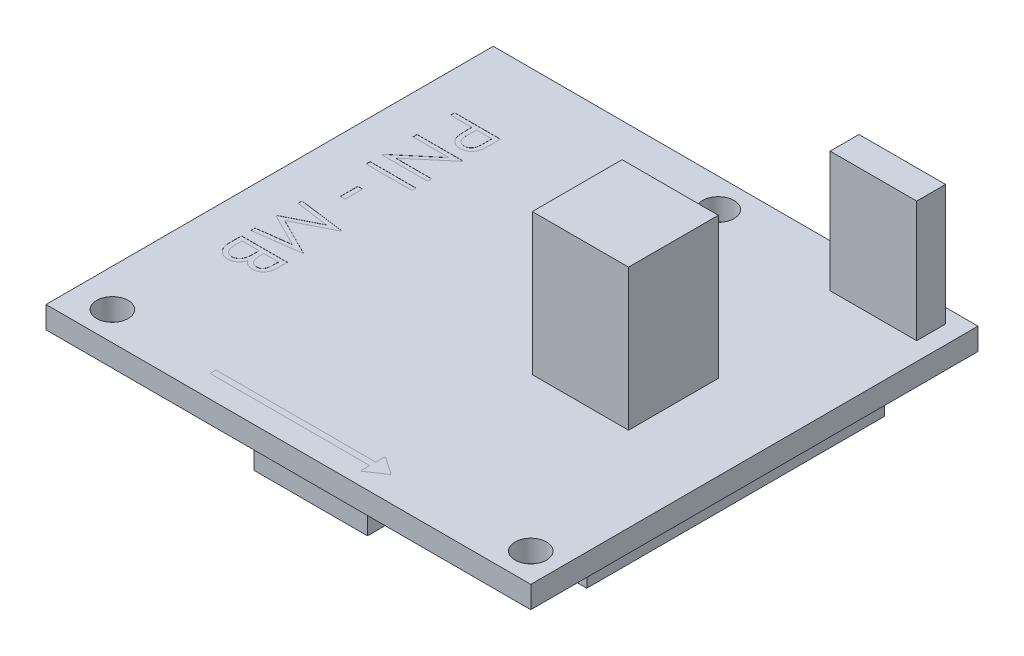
from build123d import *

# Parameters (mm, degrees)
SKETCH1_W           = 33.6
SKETCH1_H           = 31
SKETCH1_R           = 1.0922
BOSS_EXTRUDE1_DEPTH = 1.524
SKETCH2_W           = 6
SKETCH2_H           = 2
BOSS_EXTRUDE2_DEPTH = 8.382
SKETCH7_W           = 6.672135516
SKETCH7_H           = 6.2250195
BOSS_EXTRUDE4_DEPTH = 9.79
BOSS_EXTRUDE3_DEPTH = 1.9
CUT_EXTRUDE1_DEPTH  = 1.04
SKETCH8_W           = 3.175
SKETCH8_H           = 0.284935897
SKETCH8_W_2         = 0.325641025
SKETCH8_H_2         = 1.221153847
CUT_EXTRUDE2_DEPTH  = 0.01


with BuildPart() as part:
    # Sketch1 → Boss-Extrude1 (new body)
    with BuildSketch(Plane(origin=(0, 0, 0), x_dir=(1, 0, 0), z_dir=(0, 1, 0))):
        Rectangle(SKETCH1_W, SKETCH1_H)
        with Locations(Location((0.8, 13.5, 0), (0, 0, 90))):
            Circle(SKETCH1_R, mode=Mode.SUBTRACT)
        with Locations(Location((14.8, -13.5, 0), (0, 0, 90))):
            Circle(SKETCH1_R, mode=Mode.SUBTRACT)
        with Locations(Location((-14.2, -13.5, 0), (0, 0, 90))):
            Circle(SKETCH1_R, mode=Mode.SUBTRACT)
    extrude(amount=BOSS_EXTRUDE1_DEPTH)

    # Sketch2 → Boss-Extrude2 (add)
    with BuildSketch(Plane(origin=(0, 1.524, 0), x_dir=(1, 0, 0), z_dir=(0, 1, 0))):
        with Locations((12.55, 13.5)):
            Rectangle(SKETCH2_W, SKETCH2_H)
    extrude(amount=BOSS_EXTRUDE2_DEPTH)

    # Sketch7 → Boss-Extrude4 (add)
    with BuildSketch(Plane(origin=(0, 1.524, 0), x_dir=(1, 0, 0), z_dir=(0, 1, 0))):
        with Locations((7.600421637, 0.253986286)):
            Rectangle(SKETCH7_W, SKETCH7_H)
    extrude(amount=BOSS_EXTRUDE4_DEPTH)

    # Sketch3 → Boss-Extrude3 (add)
    with BuildSketch(Plane.XZ):
        Polygon((15.553080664, -10.281568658), (2.450522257, -10.281568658), (2.450522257, -9.88915281), (-3.237807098, -9.88915281), (-3.237807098, -10.546462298), (-15.542157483, -10.546462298), (-15.542157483, 7.313649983), (-3.058092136, 7.313649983), (-3.058092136, 14.823735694), (4.808676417, 14.823735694), (4.808676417, 10.369691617), (15.553080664, 10.369691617), align=None)
    extrude(amount=BOSS_EXTRUDE3_DEPTH)

    # Sketch5 → Cut-Extrude1 (cut)
    with BuildSketch(Plane.XZ.offset(1.9)):
        Polygon((12.471830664, -7.200318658), (12.471830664, 7.288441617), (1.727426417, 7.288441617), (1.727426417, 11.742485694), (0.023157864, 11.742485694), (0.023157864, 4.232399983), (-12.460907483, 4.232399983), (-12.460907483, -7.465212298), (-6.319057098, -7.465212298), (-6.319057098, -6.80790281), (5.531772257, -6.80790281), (5.531772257, -7.200318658), align=None)
    extrude(amount=-CUT_EXTRUDE1_DEPTH, mode=Mode.SUBTRACT)

    # Sketch8 → Cut-Extrude2 (cut)
    # profile 1 of 6: a face of its own
    with BuildSketch(Plane(origin=(0, 1.524, 0), x_dir=(1, 0, 0), z_dir=(0, 1, 0))):
        with BuildLine():
            Line((-10.969507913, 10.173429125), (-10.969507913, 9.550767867))
            add(Edge.make_bspline(
                [(-10.969507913, 9.550767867), (-10.96955499, 9.50794083), (-10.969645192, 9.425882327), (-10.972379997, 9.308212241), (-10.976032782, 9.201341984), (-10.981096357, 9.105501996), (-10.987080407, 9.020397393), (-10.995473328, 8.946413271), (-11.004236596, 8.882968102), (-11.013146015, 8.844952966), (-11.017209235, 8.827615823)],
                knots=[0, 0, 0, 0, 1.415646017, 2.712440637, 3.8905458, 4.950247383, 5.884950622, 6.709939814, 7.411656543, 8, 8, 8, 8], degree=3))
            add(Edge.make_bspline(
                [(-11.017209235, 8.827615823), (-11.023216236, 8.80566878), (-11.03508869, 8.762291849), (-11.058869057, 8.699789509), (-11.087062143, 8.640320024), (-11.119207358, 8.583695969), (-11.156619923, 8.530551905), (-11.198116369, 8.480207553), (-11.243673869, 8.432374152), (-11.294175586, 8.388676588), (-11.347759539, 8.348447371), (-11.40561907, 8.313936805), (-11.46649489, 8.284745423), (-11.53101044, 8.260904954), (-11.598773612, 8.242777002), (-11.669982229, 8.229383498), (-11.744391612, 8.220814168), (-11.795247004, 8.219998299), (-11.821135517, 8.219582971)],
                knots=[0, 0, 0, 0, 0.999487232, 1.975422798, 2.933948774, 3.889618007, 4.832992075, 5.786114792, 6.754729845, 7.731954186, 8.717668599, 9.695514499, 10.68728626, 11.680675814, 12.71351902, 13.766008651, 14.862761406, 16, 16, 16, 16], degree=3))
            add(Edge.make_bspline(
                [(-11.821135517, 8.219582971), (-11.847241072, 8.219965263), (-11.898318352, 8.220713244), (-11.973042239, 8.229690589), (-12.044451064, 8.241782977), (-12.112386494, 8.260376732), (-12.176445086, 8.284729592), (-12.237605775, 8.313297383), (-12.294828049, 8.347753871), (-12.348319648, 8.387345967), (-12.398130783, 8.431389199), (-12.443900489, 8.479697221), (-12.485360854, 8.532075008), (-12.522604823, 8.5883561), (-12.554768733, 8.649089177), (-12.583577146, 8.71335313), (-12.607771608, 8.781706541), (-12.620498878, 8.82900725), (-12.626969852, 8.853056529)],
                knots=[0, 0, 0, 0, 1.121902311, 2.195077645, 3.232258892, 4.234102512, 5.217864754, 6.176164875, 7.132989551, 8.084763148, 9.034132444, 9.988522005, 10.94243251, 11.903244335, 12.886203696, 13.894208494, 14.929344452, 16, 16, 16, 16], degree=3))
            add(Edge.make_bspline(
                [(-12.626969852, 8.853056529), (-12.631199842, 8.872947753), (-12.640470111, 8.916540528), (-12.650819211, 8.988334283), (-12.659652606, 9.071923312), (-12.666275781, 9.167193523), (-12.671945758, 9.274059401), (-12.676452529, 9.392578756), (-12.678928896, 9.52298424), (-12.679056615, 9.613944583), (-12.679123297, 9.661434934)],
                knots=[0, 0, 0, 0, 0.601384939, 1.31797006, 2.144135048, 3.087295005, 4.142315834, 5.309527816, 6.595305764, 8, 8, 8, 8], degree=3))
            Line((-12.679123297, 9.661434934), (-12.679123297, 9.888493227))
            Line((-12.679123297, 9.888493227), (-14.144507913, 9.888493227))
            Line((-14.144507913, 9.888493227), (-14.144507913, 10.173429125))
            Line((-14.144507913, 10.173429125), (-10.969507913, 10.173429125))
        make_face()
        with BuildLine():
            Line((-11.295148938, 9.888493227), (-12.353482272, 9.888493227))
            Line((-12.353482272, 9.888493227), (-12.360478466, 9.33261382))
            add(Edge.make_bspline(
                [(-12.360478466, 9.33261382), (-12.360495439, 9.305471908), (-12.360528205, 9.253075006), (-12.356863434, 9.177178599), (-12.352820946, 9.106944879), (-12.346490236, 9.042221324), (-12.33814893, 8.983502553), (-12.329069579, 8.930034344), (-12.316768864, 8.882599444), (-12.299617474, 8.827014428), (-12.270935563, 8.76528599), (-12.228230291, 8.698577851), (-12.175289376, 8.641128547), (-12.114947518, 8.591746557), (-12.047575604, 8.553475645), (-11.976057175, 8.52469104), (-11.900347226, 8.507924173), (-11.848564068, 8.505661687), (-11.822407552, 8.504518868)],
                knots=[0, 0, 0, 0, 1.160368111, 2.240066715, 3.248291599, 4.168343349, 5.019594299, 5.784185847, 6.485545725, 7.113397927, 8.269509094, 9.383373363, 10.487084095, 11.595623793, 12.704274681, 13.786671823, 14.88201193, 16, 16, 16, 16], degree=3))
            add(Edge.make_bspline(
                [(-11.822407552, 8.504518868), (-11.796883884, 8.50566779), (-11.746145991, 8.507951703), (-11.671750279, 8.524823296), (-11.600990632, 8.553419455), (-11.534448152, 8.592005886), (-11.474353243, 8.639969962), (-11.422607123, 8.696146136), (-11.380443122, 8.759387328), (-11.353416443, 8.818245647), (-11.336887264, 8.870493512), (-11.325327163, 8.915880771), (-11.316096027, 8.967125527), (-11.308621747, 9.024246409), (-11.302223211, 9.086800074), (-11.297881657, 9.155324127), (-11.295340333, 9.229558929), (-11.295214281, 9.281094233), (-11.295148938, 9.307809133)],
                knots=[0, 0, 0, 0, 1.120550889, 2.227516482, 3.330715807, 4.461473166, 5.594337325, 6.694900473, 7.802844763, 8.919519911, 9.52614448, 10.208195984, 10.975273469, 11.811520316, 12.738076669, 13.736566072, 14.826679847, 16, 16, 16, 16], degree=3))
            Line((-11.295148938, 9.307809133), (-11.295148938, 9.888493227))
        make_face(mode=Mode.SUBTRACT)
    # profile 2 of 6: a face of its own
    with BuildSketch(Plane(origin=(0, 1.524, 0), x_dir=(1, 0, 0), z_dir=(0, 1, 0))):
        Polygon((-14.144507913, 7.56830092), (-10.969507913, 7.56830092), (-10.969507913, 7.508515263), (-13.468421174, 5.410929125), (-10.969507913, 5.410929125), (-10.969507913, 5.125993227), (-14.144507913, 5.125993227), (-14.144507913, 5.190867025), (-11.65131881, 7.283365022), (-14.144507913, 7.283365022), align=None)
    # profile 3 of 6: a face of its own
    with BuildSketch(Plane(origin=(0, 1.524, 0), x_dir=(1, 0, 0), z_dir=(0, 1, 0))):
        with Locations((-12.557007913, 4.169422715)):
            Rectangle(SKETCH8_W, SKETCH8_H)
    # profile 4 of 6: a face of its own
    with BuildSketch(Plane(origin=(0, 1.524, 0), x_dir=(1, 0, 0), z_dir=(0, 1, 0))):
        with Locations((-12.923354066, 1.788172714)):
            Rectangle(SKETCH8_W_2, SKETCH8_H_2)
    # profile 5 of 6: a face of its own
    with BuildSketch(Plane(origin=(0, 1.524, 0), x_dir=(1, 0, 0), z_dir=(0, 1, 0))):
        Polygon((-14.144507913, -0.409904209), (-10.969507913, -0.829039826), (-10.969507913, -0.869744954), (-13.574636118, -2.180577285), (-10.969507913, -3.488229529), (-10.969507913, -3.529570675), (-14.144507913, -3.951250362), (-14.144507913, -3.66504243), (-11.859932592, -3.361026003), (-14.144507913, -2.214922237), (-14.144507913, -2.150684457), (-11.854844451, -1.000128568), (-14.144507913, -0.696748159), align=None)
    # profile 6 of 6: a face of its own
    with BuildSketch(Plane(origin=(0, 1.524, 0), x_dir=(1, 0, 0), z_dir=(0, 1, 0))):
        with BuildLine():
            Line((-10.969507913, -4.602532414), (-10.969507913, -5.222013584))
            add(Edge.make_bspline(
                [(-10.969507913, -5.222013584), (-10.969667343, -5.252337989), (-10.96997636, -5.311114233), (-10.974768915, -5.396584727), (-10.981303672, -5.476639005), (-10.991672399, -5.551300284), (-11.004183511, -5.620534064), (-11.019334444, -5.684548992), (-11.037501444, -5.743141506), (-11.06639057, -5.813093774), (-11.109319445, -5.892850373), (-11.172754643, -5.979208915), (-11.250344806, -6.05305419), (-11.337868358, -6.116723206), (-11.434148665, -6.167342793), (-11.536890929, -6.203963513), (-11.644769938, -6.227148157), (-11.718831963, -6.229532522), (-11.756261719, -6.230737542)],
                knots=[0, 0, 0, 0, 1.001505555, 1.941167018, 2.826882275, 3.653841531, 4.429895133, 5.150066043, 5.825578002, 6.45369114, 7.647487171, 8.808567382, 9.977351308, 11.170798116, 12.373658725, 13.556498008, 14.765093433, 16, 16, 16, 16], degree=3))
            add(Edge.make_bspline(
                [(-11.756261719, -6.230737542), (-11.79133105, -6.229765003), (-11.860245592, -6.227853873), (-11.960878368, -6.208956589), (-12.057066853, -6.180821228), (-12.147625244, -6.139976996), (-12.231389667, -6.087438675), (-12.307862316, -6.02421487), (-12.375189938, -5.948938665), (-12.412672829, -5.892449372), (-12.43171244, -5.86375537)],
                knots=[0, 0, 0, 0, 1.044266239, 2.052081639, 3.041743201, 4.026043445, 5.00270663, 5.980942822, 6.97441044, 8, 8, 8, 8], degree=3))
            add(Edge.make_bspline(
                [(-12.43171244, -5.86375537), (-12.445549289, -5.899829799), (-12.472022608, -5.968849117), (-12.519081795, -6.06389711), (-12.569688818, -6.146115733), (-12.625246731, -6.215595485), (-12.685881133, -6.274121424), (-12.750377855, -6.326678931), (-12.82191216, -6.370710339), (-12.898447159, -6.40853703), (-12.97944569, -6.438306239), (-13.064537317, -6.459369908), (-13.15277056, -6.472312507), (-13.212910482, -6.47407736), (-13.243270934, -6.474968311)],
                knots=[0, 0, 0, 0, 1.272302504, 2.434229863, 3.488457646, 4.447234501, 5.35599188, 6.26022912, 7.18267843, 8.11661068, 9.06895546, 10.019249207, 11.000057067, 12, 12, 12, 12], degree=3))
            add(Edge.make_bspline(
                [(-13.243270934, -6.474968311), (-13.274264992, -6.474081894), (-13.33524667, -6.472337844), (-13.424834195, -6.459478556), (-13.510436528, -6.437684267), (-13.592662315, -6.407737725), (-13.671046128, -6.368431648), (-13.746569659, -6.321628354), (-13.817221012, -6.264662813), (-13.884680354, -6.201166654), (-13.945298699, -6.129250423), (-13.999265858, -6.051669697), (-14.043851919, -5.96730861), (-14.080837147, -5.877475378), (-14.109500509, -5.781573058), (-14.129399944, -5.679957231), (-14.142839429, -5.572605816), (-14.143942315, -5.49893644), (-14.144507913, -5.461156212)],
                knots=[0, 0, 0, 0, 0.978404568, 1.925038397, 2.85041836, 3.763147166, 4.682162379, 5.614488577, 6.562659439, 7.54271123, 8.535210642, 9.526693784, 10.520907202, 11.541451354, 12.589717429, 13.675358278, 14.807842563, 16, 16, 16, 16], degree=3))
            Line((-14.144507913, -5.461156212), (-14.144507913, -4.602532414))
            Line((-14.144507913, -4.602532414), (-10.969507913, -4.602532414))
        make_face()
        with BuildLine():
            Line((-11.295148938, -4.887468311), (-12.312777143, -4.887468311))
            Line((-12.312777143, -4.887468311), (-12.312777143, -5.078909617))
            add(Edge.make_bspline(
                [(-12.312777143, -5.078909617), (-12.312417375, -5.106894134), (-12.311722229, -5.160965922), (-12.309668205, -5.239478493), (-12.304168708, -5.31217449), (-12.298352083, -5.379304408), (-12.28939567, -5.440418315), (-12.278435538, -5.495720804), (-12.266945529, -5.545708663), (-12.247350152, -5.603329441), (-12.218683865, -5.66867064), (-12.173150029, -5.73788411), (-12.120389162, -5.7998921), (-12.058387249, -5.851667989), (-11.990694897, -5.894392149), (-11.91730607, -5.922904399), (-11.841085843, -5.943127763), (-11.788622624, -5.94490122), (-11.761985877, -5.945801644)],
                knots=[0, 0, 0, 0, 1.156481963, 2.23455883, 3.244418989, 4.168404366, 5.01828131, 5.794834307, 6.498111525, 7.13526334, 8.307595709, 9.435046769, 10.546766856, 11.659452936, 12.760769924, 13.837671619, 14.902137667, 16, 16, 16, 16], degree=3))
            add(Edge.make_bspline(
                [(-11.761985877, -5.945801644), (-11.744355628, -5.945351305), (-11.709771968, -5.944467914), (-11.659551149, -5.936428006), (-11.611714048, -5.924762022), (-11.567360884, -5.906536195), (-11.525231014, -5.884497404), (-11.487195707, -5.855828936), (-11.451171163, -5.823452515), (-11.418480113, -5.785429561), (-11.389188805, -5.741944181), (-11.363415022, -5.692582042), (-11.343083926, -5.636753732), (-11.32484585, -5.575725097), (-11.312190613, -5.508519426), (-11.301609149, -5.435793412), (-11.296230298, -5.356930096), (-11.295517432, -5.302370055), (-11.295148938, -5.274167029)],
                knots=[0, 0, 0, 0, 0.911752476, 1.788502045, 2.626783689, 3.45400582, 4.26402138, 5.080402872, 5.911472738, 6.767166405, 7.66795952, 8.620018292, 9.640966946, 10.73819047, 11.913090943, 13.176185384, 14.540321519, 16, 16, 16, 16], degree=3))
            Line((-11.295148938, -5.274167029), (-11.295148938, -4.887468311))
        make_face(mode=Mode.SUBTRACT)
        with BuildLine():
            Line((-12.638418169, -4.887468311), (-13.818866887, -4.887468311))
            Line((-13.818866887, -4.887468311), (-13.818866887, -5.293247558))
            add(Edge.make_bspline(
                [(-13.818866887, -5.293247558), (-13.818519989, -5.322293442), (-13.817851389, -5.378275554), (-13.815644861, -5.459101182), (-13.810731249, -5.533811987), (-13.802720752, -5.602450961), (-13.794397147, -5.665622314), (-13.782876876, -5.722698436), (-13.769779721, -5.77376683), (-13.749511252, -5.832974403), (-13.718077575, -5.899688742), (-13.670373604, -5.971533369), (-13.614290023, -6.036046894), (-13.548562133, -6.090202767), (-13.477635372, -6.134922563), (-13.401880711, -6.166287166), (-13.323609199, -6.186454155), (-13.270104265, -6.18883726), (-13.243270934, -6.190032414)],
                knots=[0, 0, 0, 0, 1.159821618, 2.235403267, 3.228114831, 4.14795534, 4.994323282, 5.771256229, 6.471395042, 7.097801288, 8.267864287, 9.404187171, 10.531774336, 11.667624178, 12.792825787, 13.866573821, 14.930062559, 16, 16, 16, 16], degree=3))
            add(Edge.make_bspline(
                [(-13.243270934, -6.190032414), (-13.226492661, -6.189788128), (-13.193206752, -6.189303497), (-13.144329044, -6.181719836), (-13.096771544, -6.171140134), (-13.051253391, -6.155819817), (-13.007033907, -6.136502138), (-12.964883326, -6.112259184), (-12.923793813, -6.084263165), (-12.871907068, -6.040468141), (-12.812104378, -5.976827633), (-12.753561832, -5.886374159), (-12.706346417, -5.783530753), (-12.686299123, -5.708938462), (-12.675943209, -5.670406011)],
                knots=[0, 0, 0, 0, 0.723503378, 1.435336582, 2.130201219, 2.824764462, 3.504949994, 4.209866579, 4.920640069, 5.648298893, 7.13757748, 8.670694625, 10.280166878, 12, 12, 12, 12], degree=3))
            add(Edge.make_bspline(
                [(-12.675943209, -5.670406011), (-12.672808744, -5.654958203), (-12.666012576, -5.621464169), (-12.658843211, -5.566847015), (-12.652412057, -5.50428468), (-12.647779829, -5.434044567), (-12.642807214, -5.355847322), (-12.64094218, -5.269718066), (-12.638665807, -5.175595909), (-12.638502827, -5.110288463), (-12.638418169, -5.076365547)],
                knots=[0, 0, 0, 0, 0.634452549, 1.375623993, 2.216454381, 3.166361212, 4.209414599, 5.370755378, 6.634280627, 8, 8, 8, 8], degree=3))
            Line((-12.638418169, -5.076365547), (-12.638418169, -4.887468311))
        make_face(mode=Mode.SUBTRACT)
    extrude(amount=-CUT_EXTRUDE2_DEPTH, mode=Mode.SUBTRACT)


solid = part.part
